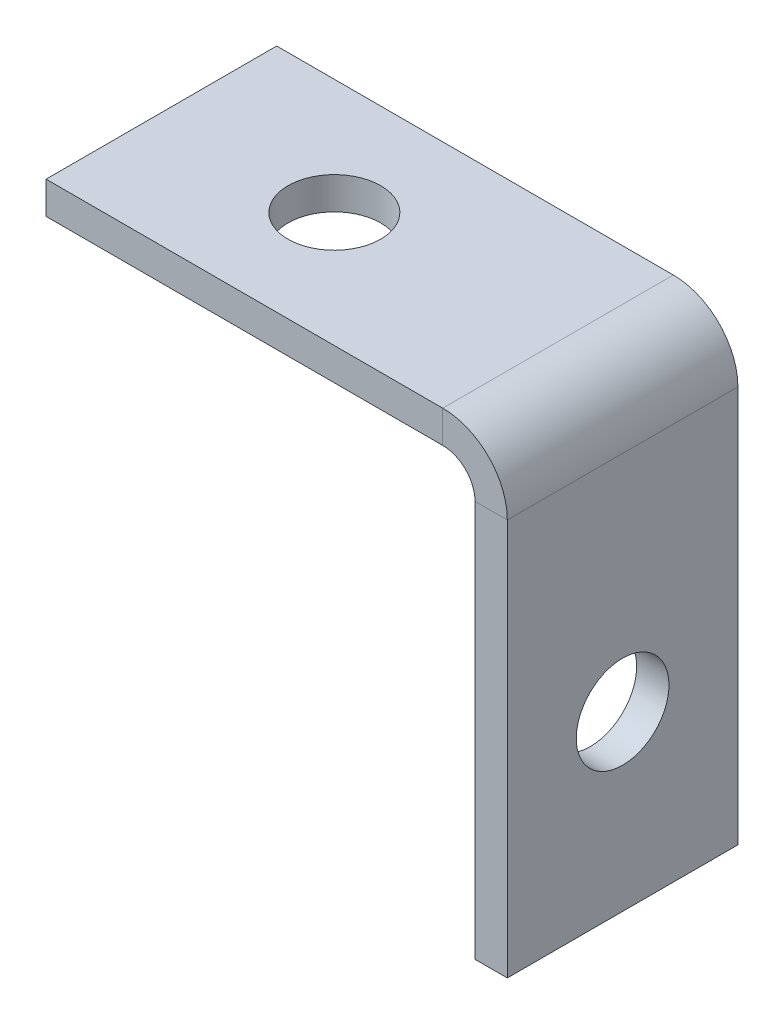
ISO-10303-21;
HEADER;
FILE_DESCRIPTION(('STEP AP214'),'2;1');
FILE_NAME('part.step','',(''),(''),'','','');
FILE_SCHEMA(('AUTOMOTIVE_DESIGN { 1 0 10303 214 1 1 1 1 }'));
ENDSEC;
DATA;
#1=APPLICATION_CONTEXT('core data for automotive mechanical design processes');
#2=APPLICATION_PROTOCOL_DEFINITION('international standard','automotive_design',2000,#1);
#3=PRODUCT_CONTEXT('',#1,'mechanical');
#4=PRODUCT('Part','Part','',(#3));
#5=PRODUCT_RELATED_PRODUCT_CATEGORY('part','',(#4));
#6=PRODUCT_DEFINITION_FORMATION('','',#4);
#7=PRODUCT_DEFINITION_CONTEXT('part definition',#1,'design');
#8=PRODUCT_DEFINITION('design','',#6,#7);
#9=PRODUCT_DEFINITION_SHAPE('','',#8);
#10=(LENGTH_UNIT() NAMED_UNIT(*) SI_UNIT(.MILLI.,.METRE.));
#11=(NAMED_UNIT(*) PLANE_ANGLE_UNIT() SI_UNIT($,.RADIAN.));
#12=(NAMED_UNIT(*) SI_UNIT($,.STERADIAN.) SOLID_ANGLE_UNIT());
#13=UNCERTAINTY_MEASURE_WITH_UNIT(LENGTH_MEASURE(1.E-05),#10,'distance_accuracy_value','');
#14=(GEOMETRIC_REPRESENTATION_CONTEXT(3) GLOBAL_UNCERTAINTY_ASSIGNED_CONTEXT((#13)) GLOBAL_UNIT_ASSIGNED_CONTEXT((#10,
#11,#12)) REPRESENTATION_CONTEXT('',''));
#15=CARTESIAN_POINT('',(0.,0.,0.));
#16=DIRECTION('',(0.,0.,1.));
#17=DIRECTION('',(1.,0.,0.));
#18=AXIS2_PLACEMENT_3D('',#15,#16,#17);
#19=CARTESIAN_POINT('',(-2.55004350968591E-13,-3.55600000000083,6.35000000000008));
#20=DIRECTION('',(0.,0.,1.00000000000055));
#21=DIRECTION('',(1.00000000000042,0.,0.));
#22=AXIS2_PLACEMENT_3D('',#19,#20,#21);
#23=PLANE('',#22);
#24=DIRECTION('',(-1.00000000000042,0.,0.));
#25=VECTOR('',#24,1.);
#26=CARTESIAN_POINT('',(-2.55004350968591E-13,-3.55600000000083,6.35000000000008));
#27=LINE('',#26,#25);
#28=CARTESIAN_POINT('',(-2.55004350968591E-13,-3.55600000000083,6.35000000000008));
#29=VERTEX_POINT('',#28);
#30=CARTESIAN_POINT('',(-1.77800000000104,-3.55600000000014,6.35000000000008));
#31=VERTEX_POINT('',#30);
#32=EDGE_CURVE('E11',#29,#31,#27,.T.);
#33=ORIENTED_EDGE('',*,*,#32,.F.);
#34=CARTESIAN_POINT('',(-3.55600000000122,-3.55599999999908,6.35000000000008));
#35=DIRECTION('',(0.,0.,1.00000000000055));
#36=DIRECTION('',(1.00000000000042,0.,0.));
#37=AXIS2_PLACEMENT_3D('',#34,#35,#36);
#38=CIRCLE('',#37,3.556);
#39=CARTESIAN_POINT('',(-3.55600000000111,0.,6.35000000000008));
#40=VERTEX_POINT('',#39);
#41=EDGE_CURVE('E138',#40,#29,#38,.F.);
#42=ORIENTED_EDGE('',*,*,#41,.F.);
#43=DIRECTION('',(0.,1.00000000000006,0.));
#44=VECTOR('',#43,1.);
#45=CARTESIAN_POINT('',(-3.55600000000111,-1.77800000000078,6.35000000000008));
#46=LINE('',#45,#44);
#47=CARTESIAN_POINT('',(-3.55600000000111,-1.77800000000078,6.35000000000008));
#48=VERTEX_POINT('',#47);
#49=EDGE_CURVE('E49',#48,#40,#46,.T.);
#50=ORIENTED_EDGE('',*,*,#49,.F.);
#51=CARTESIAN_POINT('',(-3.55600000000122,-3.55599999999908,6.35000000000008));
#52=DIRECTION('',(0.,0.,1.00000000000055));
#53=DIRECTION('',(1.00000000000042,0.,0.));
#54=AXIS2_PLACEMENT_3D('',#51,#52,#53);
#55=CIRCLE('',#54,1.778);
#56=EDGE_CURVE('E131',#48,#31,#55,.F.);
#57=ORIENTED_EDGE('',*,*,#56,.T.);
#58=EDGE_LOOP('',(#33,#42,#50,#57));
#59=FACE_BOUND('',#58,.T.);
#60=ADVANCED_FACE('F41',(#59),#23,.T.);
#61=CARTESIAN_POINT('',(-3.55600000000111,-1.77800000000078,6.35000000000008));
#62=DIRECTION('',(0.,0.,1.00000000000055));
#63=DIRECTION('',(1.00000000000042,0.,0.));
#64=AXIS2_PLACEMENT_3D('',#61,#62,#63);
#65=PLANE('',#64);
#66=DIRECTION('',(0.,-1.00000000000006,0.));
#67=VECTOR('',#66,1.);
#68=CARTESIAN_POINT('',(1.30104260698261E-13,0.,6.35000000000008));
#69=LINE('',#68,#67);
#70=CARTESIAN_POINT('',(4.90926743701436E-13,-25.4000000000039,6.35000000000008));
#71=VERTEX_POINT('',#70);
#72=EDGE_CURVE('E188',#29,#71,#69,.T.);
#73=ORIENTED_EDGE('',*,*,#72,.F.);
#74=ORIENTED_EDGE('',*,*,#32,.T.);
#75=DIRECTION('',(0.,-1.00000000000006,0.));
#76=VECTOR('',#75,1.);
#77=CARTESIAN_POINT('',(-1.77800000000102,1.22298005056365E-13,6.35000000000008));
#78=LINE('',#77,#76);
#79=CARTESIAN_POINT('',(-1.7780000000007,-25.4000000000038,6.35000000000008));
#80=VERTEX_POINT('',#79);
#81=EDGE_CURVE('E97',#31,#80,#78,.T.);
#82=ORIENTED_EDGE('',*,*,#81,.T.);
#83=DIRECTION('',(-1.00000000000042,0.,0.));
#84=VECTOR('',#83,1.);
#85=CARTESIAN_POINT('',(4.90926743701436E-13,-25.4000000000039,6.35000000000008));
#86=LINE('',#85,#84);
#87=EDGE_CURVE('E351',#71,#80,#86,.T.);
#88=ORIENTED_EDGE('',*,*,#87,.F.);
#89=EDGE_LOOP('',(#73,#74,#82,#88));
#90=FACE_BOUND('',#89,.T.);
#91=ADVANCED_FACE('F196',(#90),#65,.T.);
#92=CARTESIAN_POINT('',(-3.55600000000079,0.,-6.35000000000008));
#93=DIRECTION('',(0.,0.,-1.00000000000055));
#94=DIRECTION('',(-1.00000000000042,0.,0.));
#95=AXIS2_PLACEMENT_3D('',#92,#93,#94);
#96=PLANE('',#95);
#97=DIRECTION('',(0.,-1.00000000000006,0.));
#98=VECTOR('',#97,1.);
#99=CARTESIAN_POINT('',(-3.55600000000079,0.,-6.35000000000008));
#100=LINE('',#99,#98);
#101=CARTESIAN_POINT('',(-3.55600000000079,0.,-6.35000000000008));
#102=VERTEX_POINT('',#101);
#103=CARTESIAN_POINT('',(-3.55600000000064,-1.77800000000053,-6.35000000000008));
#104=VERTEX_POINT('',#103);
#105=EDGE_CURVE('E84',#102,#104,#100,.T.);
#106=ORIENTED_EDGE('',*,*,#105,.F.);
#107=CARTESIAN_POINT('',(-3.55600000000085,-3.55599999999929,-6.35000000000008));
#108=DIRECTION('',(0.,0.,1.00000000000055));
#109=DIRECTION('',(1.00000000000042,0.,0.));
#110=AXIS2_PLACEMENT_3D('',#107,#108,#109);
#111=CIRCLE('',#110,3.556);
#112=CARTESIAN_POINT('',(0.,-3.55600000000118,-6.35000000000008));
#113=VERTEX_POINT('',#112);
#114=EDGE_CURVE('E154',#102,#113,#111,.F.);
#115=ORIENTED_EDGE('',*,*,#114,.T.);
#116=DIRECTION('',(1.00000000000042,0.,0.));
#117=VECTOR('',#116,1.);
#118=CARTESIAN_POINT('',(-1.77800000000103,-3.5560000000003,-6.35000000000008));
#119=LINE('',#118,#117);
#120=CARTESIAN_POINT('',(-1.77800000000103,-3.5560000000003,-6.35000000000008));
#121=VERTEX_POINT('',#120);
#122=EDGE_CURVE('E91',#121,#113,#119,.T.);
#123=ORIENTED_EDGE('',*,*,#122,.F.);
#124=CARTESIAN_POINT('',(-3.55600000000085,-3.55599999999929,-6.35000000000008));
#125=DIRECTION('',(0.,0.,1.00000000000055));
#126=DIRECTION('',(1.00000000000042,0.,0.));
#127=AXIS2_PLACEMENT_3D('',#124,#125,#126);
#128=CIRCLE('',#127,1.778);
#129=EDGE_CURVE('E161',#104,#121,#128,.F.);
#130=ORIENTED_EDGE('',*,*,#129,.F.);
#131=EDGE_LOOP('',(#106,#115,#123,#130));
#132=FACE_BOUND('',#131,.T.);
#133=ADVANCED_FACE('F194',(#132),#96,.T.);
#134=CARTESIAN_POINT('',(-1.77800000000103,-3.5560000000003,-6.35000000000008));
#135=DIRECTION('',(0.,0.,-1.00000000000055));
#136=DIRECTION('',(-1.00000000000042,0.,0.));
#137=AXIS2_PLACEMENT_3D('',#134,#135,#136);
#138=PLANE('',#137);
#139=DIRECTION('',(1.00000000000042,0.,0.));
#140=VECTOR('',#139,1.);
#141=CARTESIAN_POINT('',(0.,1.93421667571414E-13,-6.35000000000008));
#142=LINE('',#141,#140);
#143=CARTESIAN_POINT('',(-25.4000000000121,0.,-6.35000000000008));
#144=VERTEX_POINT('',#143);
#145=EDGE_CURVE('E156',#144,#102,#142,.T.);
#146=ORIENTED_EDGE('',*,*,#145,.T.);
#147=ORIENTED_EDGE('',*,*,#105,.T.);
#148=DIRECTION('',(1.00000000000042,0.,0.));
#149=VECTOR('',#148,1.);
#150=CARTESIAN_POINT('',(-1.05818132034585E-13,-1.77800000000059,-6.35000000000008));
#151=LINE('',#150,#149);
#152=CARTESIAN_POINT('',(-25.4000000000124,-1.77800000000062,-6.35000000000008));
#153=VERTEX_POINT('',#152);
#154=EDGE_CURVE('E159',#153,#104,#151,.T.);
#155=ORIENTED_EDGE('',*,*,#154,.F.);
#156=DIRECTION('',(0.,1.00000000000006,0.));
#157=VECTOR('',#156,1.);
#158=CARTESIAN_POINT('',(-25.4000000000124,-1.77800000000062,-6.35000000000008));
#159=LINE('',#158,#157);
#160=EDGE_CURVE('E119',#153,#144,#159,.T.);
#161=ORIENTED_EDGE('',*,*,#160,.T.);
#162=EDGE_LOOP('',(#146,#147,#155,#161));
#163=FACE_BOUND('',#162,.T.);
#164=ADVANCED_FACE('F190',(#163),#138,.T.);
#165=CARTESIAN_POINT('',(-1.77800000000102,1.22298005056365E-13,6.35000000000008));
#166=DIRECTION('',(1.00000000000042,0.,0.));
#167=DIRECTION('',(0.,1.00000000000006,0.));
#168=AXIS2_PLACEMENT_3D('',#165,#166,#167);
#169=PLANE('',#168);
#170=CARTESIAN_POINT('',(-1.778000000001,-15.8749999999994,0.));
#171=DIRECTION('',(-1.00000000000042,0.,0.));
#172=DIRECTION('',(0.,-1.00000000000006,0.));
#173=AXIS2_PLACEMENT_3D('',#170,#171,#172);
#174=CIRCLE('',#173,2.5527);
#175=CARTESIAN_POINT('',(-1.77800000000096,-18.4276999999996,0.));
#176=VERTEX_POINT('',#175);
#177=EDGE_CURVE('E341',#176,#176,#174,.T.);
#178=ORIENTED_EDGE('',*,*,#177,.F.);
#179=EDGE_LOOP('',(#178));
#180=FACE_BOUND('',#179,.T.);
#181=DIRECTION('',(0.,-1.00000000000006,0.));
#182=VECTOR('',#181,1.);
#183=CARTESIAN_POINT('',(-1.77800000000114,0.,-6.35000000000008));
#184=LINE('',#183,#182);
#185=CARTESIAN_POINT('',(-1.77800000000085,-25.4000000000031,-6.35000000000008));
#186=VERTEX_POINT('',#185);
#187=EDGE_CURVE('E144',#121,#186,#184,.T.);
#188=ORIENTED_EDGE('',*,*,#187,.T.);
#189=DIRECTION('',(0.,0.,-1.00000000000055));
#190=VECTOR('',#189,1.);
#191=CARTESIAN_POINT('',(-1.7780000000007,-25.4000000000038,6.35000000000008));
#192=LINE('',#191,#190);
#193=EDGE_CURVE('E175',#80,#186,#192,.T.);
#194=ORIENTED_EDGE('',*,*,#193,.F.);
#195=ORIENTED_EDGE('',*,*,#81,.F.);
#196=DIRECTION('',(0.,0.,-1.00000000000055));
#197=VECTOR('',#196,1.);
#198=CARTESIAN_POINT('',(-1.77800000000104,-3.55600000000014,6.35000000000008));
#199=LINE('',#198,#197);
#200=EDGE_CURVE('E143',#31,#121,#199,.T.);
#201=ORIENTED_EDGE('',*,*,#200,.T.);
#202=EDGE_LOOP('',(#188,#194,#195,#201));
#203=FACE_BOUND('',#202,.T.);
#204=ADVANCED_FACE('F202',(#180,#203),#169,.F.);
#205=CARTESIAN_POINT('',(4.90926743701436E-13,-25.4000000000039,6.35000000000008));
#206=DIRECTION('',(0.,-1.00000000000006,0.));
#207=DIRECTION('',(1.00000000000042,0.,0.));
#208=AXIS2_PLACEMENT_3D('',#205,#206,#207);
#209=PLANE('',#208);
#210=DIRECTION('',(-1.00000000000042,0.,0.));
#211=VECTOR('',#210,1.);
#212=CARTESIAN_POINT('',(3.13984949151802E-13,-25.4000000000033,-6.35000000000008));
#213=LINE('',#212,#211);
#214=CARTESIAN_POINT('',(3.13984949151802E-13,-25.4000000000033,-6.35000000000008));
#215=VERTEX_POINT('',#214);
#216=EDGE_CURVE('E147',#215,#186,#213,.T.);
#217=ORIENTED_EDGE('',*,*,#216,.F.);
#218=DIRECTION('',(0.,0.,-1.00000000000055));
#219=VECTOR('',#218,1.);
#220=CARTESIAN_POINT('',(4.90926743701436E-13,-25.4000000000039,6.35000000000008));
#221=LINE('',#220,#219);
#222=EDGE_CURVE('E173',#71,#215,#221,.T.);
#223=ORIENTED_EDGE('',*,*,#222,.F.);
#224=ORIENTED_EDGE('',*,*,#87,.T.);
#225=ORIENTED_EDGE('',*,*,#193,.T.);
#226=EDGE_LOOP('',(#217,#223,#224,#225));
#227=FACE_BOUND('',#226,.T.);
#228=ADVANCED_FACE('F234',(#227),#209,.T.);
#229=CARTESIAN_POINT('',(1.30104260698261E-13,0.,6.35000000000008));
#230=DIRECTION('',(1.00000000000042,0.,0.));
#231=DIRECTION('',(0.,1.00000000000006,0.));
#232=AXIS2_PLACEMENT_3D('',#229,#230,#231);
#233=PLANE('',#232);
#234=CARTESIAN_POINT('',(3.78169717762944E-13,-15.8749999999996,0.));
#235=DIRECTION('',(-1.00000000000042,0.,0.));
#236=DIRECTION('',(0.,-1.00000000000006,0.));
#237=AXIS2_PLACEMENT_3D('',#234,#235,#236);
#238=CIRCLE('',#237,2.5527);
#239=CARTESIAN_POINT('',(4.16882986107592E-13,-18.4276999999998,0.));
#240=VERTEX_POINT('',#239);
#241=EDGE_CURVE('E338',#240,#240,#238,.T.);
#242=ORIENTED_EDGE('',*,*,#241,.T.);
#243=EDGE_LOOP('',(#242));
#244=FACE_BOUND('',#243,.T.);
#245=DIRECTION('',(0.,-1.00000000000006,0.));
#246=VECTOR('',#245,1.);
#247=CARTESIAN_POINT('',(0.,1.93421667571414E-13,-6.35000000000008));
#248=LINE('',#247,#246);
#249=EDGE_CURVE('E151',#113,#215,#248,.T.);
#250=ORIENTED_EDGE('',*,*,#249,.F.);
#251=DIRECTION('',(0.,0.,-1.00000000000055));
#252=VECTOR('',#251,1.);
#253=CARTESIAN_POINT('',(-2.55004350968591E-13,-3.55600000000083,6.35000000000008));
#254=LINE('',#253,#252);
#255=EDGE_CURVE('E170',#29,#113,#254,.T.);
#256=ORIENTED_EDGE('',*,*,#255,.F.);
#257=ORIENTED_EDGE('',*,*,#72,.T.);
#258=ORIENTED_EDGE('',*,*,#222,.T.);
#259=EDGE_LOOP('',(#250,#256,#257,#258));
#260=FACE_BOUND('',#259,.T.);
#261=ADVANCED_FACE('F244',(#244,#260),#233,.T.);
#262=CARTESIAN_POINT('',(-3.55600000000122,-3.55599999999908,6.35000000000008));
#263=DIRECTION('',(0.,0.,-1.00000000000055));
#264=DIRECTION('',(-1.00000000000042,0.,0.));
#265=AXIS2_PLACEMENT_3D('',#262,#263,#264);
#266=CYLINDRICAL_SURFACE('',#265,3.556);
#267=ORIENTED_EDGE('',*,*,#114,.F.);
#268=DIRECTION('',(0.,0.,-1.00000000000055));
#269=VECTOR('',#268,1.);
#270=CARTESIAN_POINT('',(-3.55600000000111,0.,6.35000000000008));
#271=LINE('',#270,#269);
#272=EDGE_CURVE('E167',#40,#102,#271,.T.);
#273=ORIENTED_EDGE('',*,*,#272,.F.);
#274=ORIENTED_EDGE('',*,*,#41,.T.);
#275=ORIENTED_EDGE('',*,*,#255,.T.);
#276=EDGE_LOOP('',(#267,#273,#274,#275));
#277=FACE_BOUND('',#276,.T.);
#278=ADVANCED_FACE('F184',(#277),#266,.T.);
#279=CARTESIAN_POINT('',(1.30104260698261E-13,0.,6.35000000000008));
#280=DIRECTION('',(0.,1.00000000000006,0.));
#281=DIRECTION('',(0.,0.,1.00000000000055));
#282=AXIS2_PLACEMENT_3D('',#279,#280,#281);
#283=PLANE('',#282);
#284=CARTESIAN_POINT('',(-15.8750000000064,3.0444397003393E-13,0.));
#285=DIRECTION('',(0.,-1.00000000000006,0.));
#286=DIRECTION('',(0.,0.,-1.00000000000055));
#287=AXIS2_PLACEMENT_3D('',#284,#285,#286);
#288=CIRCLE('',#287,2.5527);
#289=CARTESIAN_POINT('',(-15.8750000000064,3.29227629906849E-13,-2.5527000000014));
#290=VERTEX_POINT('',#289);
#291=EDGE_CURVE('E148',#290,#290,#288,.T.);
#292=ORIENTED_EDGE('',*,*,#291,.T.);
#293=EDGE_LOOP('',(#292));
#294=FACE_BOUND('',#293,.T.);
#295=ORIENTED_EDGE('',*,*,#145,.F.);
#296=DIRECTION('',(0.,0.,-1.00000000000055));
#297=VECTOR('',#296,1.);
#298=CARTESIAN_POINT('',(-25.4000000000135,-1.81278603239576E-13,6.35000000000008));
#299=LINE('',#298,#297);
#300=CARTESIAN_POINT('',(-25.4000000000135,-1.81278603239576E-13,6.35000000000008));
#301=VERTEX_POINT('',#300);
#302=EDGE_CURVE('E121',#301,#144,#299,.T.);
#303=ORIENTED_EDGE('',*,*,#302,.F.);
#304=DIRECTION('',(1.00000000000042,0.,0.));
#305=VECTOR('',#304,1.);
#306=CARTESIAN_POINT('',(1.30104260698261E-13,0.,6.35000000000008));
#307=LINE('',#306,#305);
#308=EDGE_CURVE('E136',#301,#40,#307,.T.);
#309=ORIENTED_EDGE('',*,*,#308,.T.);
#310=ORIENTED_EDGE('',*,*,#272,.T.);
#311=EDGE_LOOP('',(#295,#303,#309,#310));
#312=FACE_BOUND('',#311,.T.);
#313=ADVANCED_FACE('F189',(#294,#312),#283,.T.);
#314=CARTESIAN_POINT('',(-25.4000000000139,-1.77800000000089,6.35000000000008));
#315=DIRECTION('',(-1.00000000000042,0.,0.));
#316=DIRECTION('',(0.,0.,1.00000000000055));
#317=AXIS2_PLACEMENT_3D('',#314,#315,#316);
#318=PLANE('',#317);
#319=ORIENTED_EDGE('',*,*,#160,.F.);
#320=DIRECTION('',(0.,0.,-1.00000000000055));
#321=VECTOR('',#320,1.);
#322=CARTESIAN_POINT('',(-25.4000000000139,-1.77800000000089,6.35000000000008));
#323=LINE('',#322,#321);
#324=CARTESIAN_POINT('',(-25.4000000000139,-1.77800000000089,6.35000000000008));
#325=VERTEX_POINT('',#324);
#326=EDGE_CURVE('E113',#325,#153,#323,.T.);
#327=ORIENTED_EDGE('',*,*,#326,.F.);
#328=DIRECTION('',(0.,1.00000000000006,0.));
#329=VECTOR('',#328,1.);
#330=CARTESIAN_POINT('',(-25.4000000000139,-1.77800000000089,6.35000000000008));
#331=LINE('',#330,#329);
#332=EDGE_CURVE('E117',#325,#301,#331,.T.);
#333=ORIENTED_EDGE('',*,*,#332,.T.);
#334=ORIENTED_EDGE('',*,*,#302,.T.);
#335=EDGE_LOOP('',(#319,#327,#333,#334));
#336=FACE_BOUND('',#335,.T.);
#337=ADVANCED_FACE('F115',(#336),#318,.T.);
#338=CARTESIAN_POINT('',(0.,-1.77800000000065,6.35000000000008));
#339=DIRECTION('',(0.,1.00000000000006,0.));
#340=DIRECTION('',(0.,0.,1.00000000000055));
#341=AXIS2_PLACEMENT_3D('',#338,#339,#340);
#342=PLANE('',#341);
#343=CARTESIAN_POINT('',(-15.8750000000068,-1.77800000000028,0.));
#344=DIRECTION('',(0.,-1.00000000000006,0.));
#345=DIRECTION('',(0.,0.,-1.00000000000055));
#346=AXIS2_PLACEMENT_3D('',#343,#344,#345);
#347=CIRCLE('',#346,2.5527);
#348=CARTESIAN_POINT('',(-15.8750000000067,-1.77800000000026,-2.5527000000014));
#349=VERTEX_POINT('',#348);
#350=EDGE_CURVE('E343',#349,#349,#347,.T.);
#351=ORIENTED_EDGE('',*,*,#350,.F.);
#352=EDGE_LOOP('',(#351));
#353=FACE_BOUND('',#352,.T.);
#354=ORIENTED_EDGE('',*,*,#154,.T.);
#355=DIRECTION('',(0.,0.,-1.00000000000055));
#356=VECTOR('',#355,1.);
#357=CARTESIAN_POINT('',(-3.55600000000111,-1.77800000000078,6.35000000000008));
#358=LINE('',#357,#356);
#359=EDGE_CURVE('E122',#48,#104,#358,.T.);
#360=ORIENTED_EDGE('',*,*,#359,.F.);
#361=DIRECTION('',(1.00000000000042,0.,0.));
#362=VECTOR('',#361,1.);
#363=CARTESIAN_POINT('',(0.,-1.77800000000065,6.35000000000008));
#364=LINE('',#363,#362);
#365=EDGE_CURVE('E126',#325,#48,#364,.T.);
#366=ORIENTED_EDGE('',*,*,#365,.F.);
#367=ORIENTED_EDGE('',*,*,#326,.T.);
#368=EDGE_LOOP('',(#354,#360,#366,#367));
#369=FACE_BOUND('',#368,.T.);
#370=ADVANCED_FACE('F127',(#353,#369),#342,.F.);
#371=CARTESIAN_POINT('',(-3.55600000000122,-3.55599999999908,6.35000000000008));
#372=DIRECTION('',(0.,0.,-1.00000000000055));
#373=DIRECTION('',(-1.00000000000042,0.,0.));
#374=AXIS2_PLACEMENT_3D('',#371,#372,#373);
#375=CYLINDRICAL_SURFACE('',#374,1.778);
#376=ORIENTED_EDGE('',*,*,#129,.T.);
#377=ORIENTED_EDGE('',*,*,#200,.F.);
#378=ORIENTED_EDGE('',*,*,#56,.F.);
#379=ORIENTED_EDGE('',*,*,#359,.T.);
#380=EDGE_LOOP('',(#376,#377,#378,#379));
#381=FACE_BOUND('',#380,.T.);
#382=ADVANCED_FACE('F192',(#381),#375,.F.);
#383=CARTESIAN_POINT('',(-3.55600000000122,-3.55599999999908,6.35000000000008));
#384=DIRECTION('',(0.,0.,1.00000000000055));
#385=DIRECTION('',(1.00000000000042,0.,0.));
#386=AXIS2_PLACEMENT_3D('',#383,#384,#385);
#387=PLANE('',#386);
#388=ORIENTED_EDGE('',*,*,#365,.T.);
#389=ORIENTED_EDGE('',*,*,#49,.T.);
#390=ORIENTED_EDGE('',*,*,#308,.F.);
#391=ORIENTED_EDGE('',*,*,#332,.F.);
#392=EDGE_LOOP('',(#388,#389,#390,#391));
#393=FACE_BOUND('',#392,.T.);
#394=ADVANCED_FACE('F134',(#393),#387,.T.);
#395=CARTESIAN_POINT('',(-3.55600000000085,-3.55599999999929,-6.35000000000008));
#396=DIRECTION('',(0.,0.,1.00000000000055));
#397=DIRECTION('',(1.00000000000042,0.,0.));
#398=AXIS2_PLACEMENT_3D('',#395,#396,#397);
#399=PLANE('',#398);
#400=ORIENTED_EDGE('',*,*,#187,.F.);
#401=ORIENTED_EDGE('',*,*,#122,.T.);
#402=ORIENTED_EDGE('',*,*,#249,.T.);
#403=ORIENTED_EDGE('',*,*,#216,.T.);
#404=EDGE_LOOP('',(#400,#401,#402,#403));
#405=FACE_BOUND('',#404,.T.);
#406=ADVANCED_FACE('F304',(#405),#399,.F.);
#407=CARTESIAN_POINT('',(-15.8750000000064,3.0444397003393E-13,0.));
#408=DIRECTION('',(0.,-1.00000000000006,0.));
#409=DIRECTION('',(0.,0.,-1.00000000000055));
#410=AXIS2_PLACEMENT_3D('',#407,#408,#409);
#411=CYLINDRICAL_SURFACE('',#410,2.5527);
#412=ORIENTED_EDGE('',*,*,#291,.F.);
#413=EDGE_LOOP('',(#412));
#414=FACE_BOUND('',#413,.T.);
#415=ORIENTED_EDGE('',*,*,#350,.T.);
#416=EDGE_LOOP('',(#415));
#417=FACE_BOUND('',#416,.T.);
#418=ADVANCED_FACE('F312',(#414,#417),#411,.F.);
#419=CARTESIAN_POINT('',(3.78169717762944E-13,-15.8749999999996,0.));
#420=DIRECTION('',(-1.00000000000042,0.,0.));
#421=DIRECTION('',(0.,-1.00000000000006,0.));
#422=AXIS2_PLACEMENT_3D('',#419,#420,#421);
#423=CYLINDRICAL_SURFACE('',#422,2.5527);
#424=ORIENTED_EDGE('',*,*,#241,.F.);
#425=EDGE_LOOP('',(#424));
#426=FACE_BOUND('',#425,.T.);
#427=ORIENTED_EDGE('',*,*,#177,.T.);
#428=EDGE_LOOP('',(#427));
#429=FACE_BOUND('',#428,.T.);
#430=ADVANCED_FACE('F322',(#426,#429),#423,.F.);
#431=CLOSED_SHELL('',(#60,#91,#133,#164,#204,#228,#261,#278,#313,#337,#370,#382,#394,#406,#418,#430));
#432=MANIFOLD_SOLID_BREP('B2',#431);
#433=ADVANCED_BREP_SHAPE_REPRESENTATION('',(#18,#432),#14);
#434=SHAPE_DEFINITION_REPRESENTATION(#9,#433);
ENDSEC;
END-ISO-10303-21;
